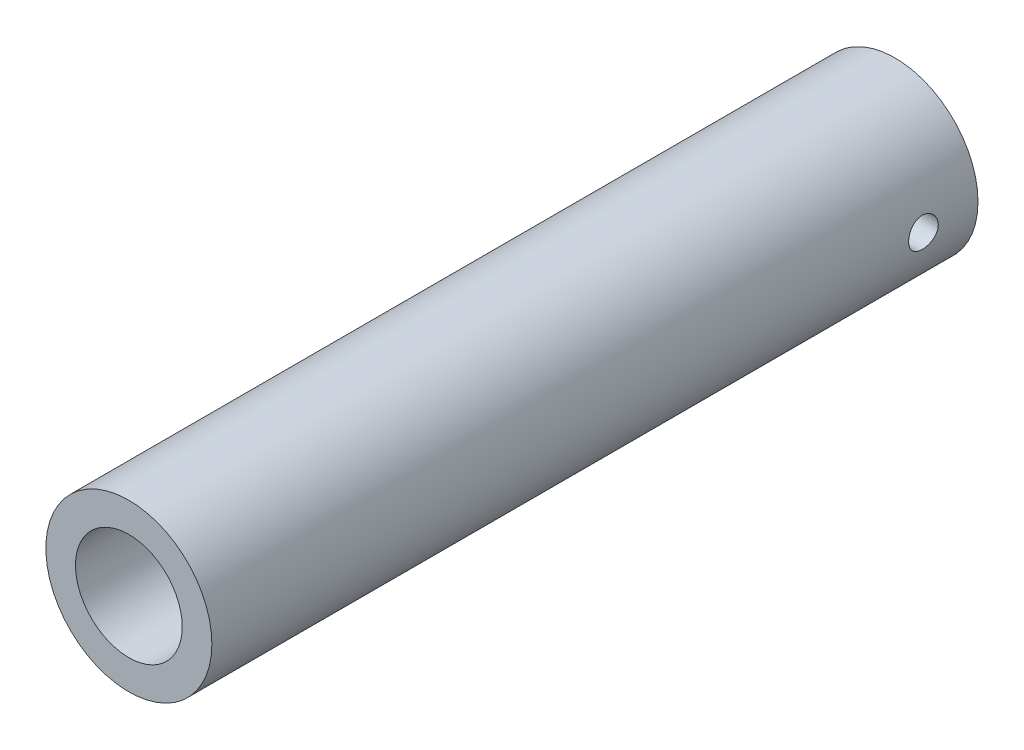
from build123d import *

# Parameters (mm, degrees)
ESQUISSE1_R             = 14
ESQUISSE1_R_2           = 9
EXTRUSION1_DEPTH        = 129.2
ESQUISSE2_R             = 2.5
ENL_V_MAT_EXTRU_1_DEPTH = 15


with BuildPart() as part:
    # Esquisse1 → Extrusion1 (new body)
    with BuildSketch(Plane.XY):
        Circle(ESQUISSE1_R)
        Circle(ESQUISSE1_R_2, mode=Mode.SUBTRACT)
    extrude(amount=EXTRUSION1_DEPTH)

    # Esquisse2 → Enl_v. mat.-Extru.1 (cut, symmetric)
    with BuildSketch(Plane(origin=(0, 0, 0), x_dir=(0, 0, -1), z_dir=(1, 0, 0))):
        with Locations((-9.2, 0)):
            Circle(ESQUISSE2_R)
    extrude(amount=ENL_V_MAT_EXTRU_1_DEPTH, both=True, mode=Mode.SUBTRACT)


solid = part.part
